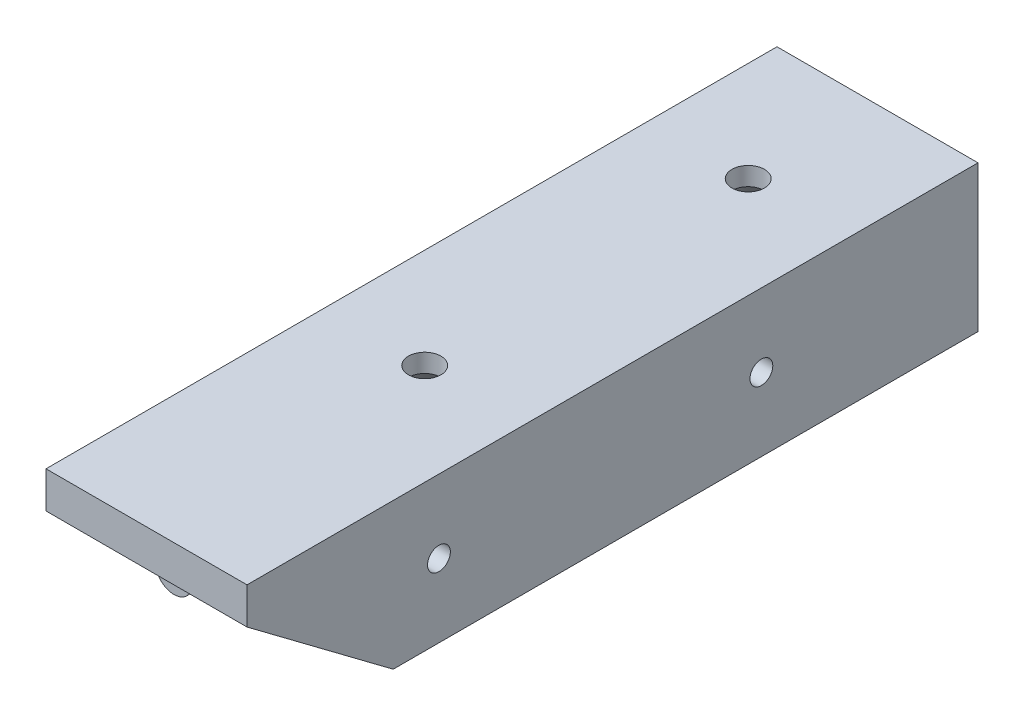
ISO-10303-21;
HEADER;
FILE_DESCRIPTION(('STEP AP214'),'2;1');
FILE_NAME('part.step','',(''),(''),'','','');
FILE_SCHEMA(('AUTOMOTIVE_DESIGN { 1 0 10303 214 1 1 1 1 }'));
ENDSEC;
DATA;
#1=APPLICATION_CONTEXT('core data for automotive mechanical design processes');
#2=APPLICATION_PROTOCOL_DEFINITION('international standard','automotive_design',2000,#1);
#3=PRODUCT_CONTEXT('',#1,'mechanical');
#4=PRODUCT('Part','Part','',(#3));
#5=PRODUCT_RELATED_PRODUCT_CATEGORY('part','',(#4));
#6=PRODUCT_DEFINITION_FORMATION('','',#4);
#7=PRODUCT_DEFINITION_CONTEXT('part definition',#1,'design');
#8=PRODUCT_DEFINITION('design','',#6,#7);
#9=PRODUCT_DEFINITION_SHAPE('','',#8);
#10=(LENGTH_UNIT() NAMED_UNIT(*) SI_UNIT(.MILLI.,.METRE.));
#11=(NAMED_UNIT(*) PLANE_ANGLE_UNIT() SI_UNIT($,.RADIAN.));
#12=(NAMED_UNIT(*) SI_UNIT($,.STERADIAN.) SOLID_ANGLE_UNIT());
#13=UNCERTAINTY_MEASURE_WITH_UNIT(LENGTH_MEASURE(1.E-05),#10,'distance_accuracy_value','');
#14=(GEOMETRIC_REPRESENTATION_CONTEXT(3) GLOBAL_UNCERTAINTY_ASSIGNED_CONTEXT((#13)) GLOBAL_UNIT_ASSIGNED_CONTEXT((#10,
#11,#12)) REPRESENTATION_CONTEXT('',''));
#15=CARTESIAN_POINT('',(0.,0.,0.));
#16=DIRECTION('',(0.,0.,1.));
#17=DIRECTION('',(1.,0.,0.));
#18=AXIS2_PLACEMENT_3D('',#15,#16,#17);
#19=CARTESIAN_POINT('',(-29.0033930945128,3.21723071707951,20.));
#20=DIRECTION('',(1.,0.,0.));
#21=DIRECTION('',(0.,0.,-1.));
#22=AXIS2_PLACEMENT_3D('',#19,#20,#21);
#23=PLANE('',#22);
#24=DIRECTION('',(0.,0.,1.));
#25=VECTOR('',#24,1.);
#26=CARTESIAN_POINT('',(-29.0033930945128,4.21723071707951,0.));
#27=LINE('',#26,#25);
#28=CARTESIAN_POINT('',(-29.0033930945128,4.21723071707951,20.));
#29=VERTEX_POINT('',#28);
#30=CARTESIAN_POINT('',(-29.0033930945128,4.21723071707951,21.));
#31=VERTEX_POINT('',#30);
#32=EDGE_CURVE('E192',#29,#31,#27,.T.);
#33=ORIENTED_EDGE('',*,*,#32,.T.);
#34=DIRECTION('',(0.,1.,0.));
#35=VECTOR('',#34,1.);
#36=CARTESIAN_POINT('',(-29.0033930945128,3.21723071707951,21.));
#37=LINE('',#36,#35);
#38=CARTESIAN_POINT('',(-29.0033930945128,5.21723071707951,21.));
#39=VERTEX_POINT('',#38);
#40=EDGE_CURVE('E238',#31,#39,#37,.T.);
#41=ORIENTED_EDGE('',*,*,#40,.T.);
#42=DIRECTION('',(0.,0.,-1.));
#43=VECTOR('',#42,1.);
#44=CARTESIAN_POINT('',(-29.0033930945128,5.21723071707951,20.));
#45=LINE('',#44,#43);
#46=CARTESIAN_POINT('',(-29.0033930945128,5.21723071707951,20.));
#47=VERTEX_POINT('',#46);
#48=EDGE_CURVE('E226',#39,#47,#45,.T.);
#49=ORIENTED_EDGE('',*,*,#48,.T.);
#50=DIRECTION('',(0.,1.,0.));
#51=VECTOR('',#50,1.);
#52=CARTESIAN_POINT('',(-29.0033930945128,3.21723071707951,20.));
#53=LINE('',#52,#51);
#54=EDGE_CURVE('E244',#29,#47,#53,.T.);
#55=ORIENTED_EDGE('',*,*,#54,.F.);
#56=EDGE_LOOP('',(#33,#41,#49,#55));
#57=FACE_BOUND('',#56,.T.);
#58=ADVANCED_FACE('F32',(#57),#23,.F.);
#59=CARTESIAN_POINT('',(-27.0033930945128,3.21723071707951,20.));
#60=DIRECTION('',(0.,0.,1.));
#61=DIRECTION('',(1.,0.,0.));
#62=AXIS2_PLACEMENT_3D('',#59,#60,#61);
#63=PLANE('',#62);
#64=CARTESIAN_POINT('',(-28.0033930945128,4.25896067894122,20.));
#65=DIRECTION('',(0.,0.,1.));
#66=DIRECTION('',(1.,0.,0.));
#67=AXIS2_PLACEMENT_3D('',#64,#65,#66);
#68=CIRCLE('',#67,1.0008703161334);
#69=CARTESIAN_POINT('',(-27.0033930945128,4.21723071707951,20.));
#70=VERTEX_POINT('',#69);
#71=EDGE_CURVE('E496',#29,#70,#68,.T.);
#72=ORIENTED_EDGE('',*,*,#71,.F.);
#73=ORIENTED_EDGE('',*,*,#54,.T.);
#74=DIRECTION('',(1.,0.,0.));
#75=VECTOR('',#74,1.);
#76=CARTESIAN_POINT('',(-27.0033930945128,5.21723071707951,20.));
#77=LINE('',#76,#75);
#78=CARTESIAN_POINT('',(-27.0033930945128,5.21723071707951,20.));
#79=VERTEX_POINT('',#78);
#80=EDGE_CURVE('E229',#47,#79,#77,.T.);
#81=ORIENTED_EDGE('',*,*,#80,.T.);
#82=DIRECTION('',(0.,1.,0.));
#83=VECTOR('',#82,1.);
#84=CARTESIAN_POINT('',(-27.0033930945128,3.21723071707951,20.));
#85=LINE('',#84,#83);
#86=EDGE_CURVE('E242',#70,#79,#85,.T.);
#87=ORIENTED_EDGE('',*,*,#86,.F.);
#88=EDGE_LOOP('',(#72,#73,#81,#87));
#89=FACE_BOUND('',#88,.T.);
#90=ADVANCED_FACE('F359',(#89),#63,.F.);
#91=CARTESIAN_POINT('',(-27.0033930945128,3.21723071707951,20.));
#92=DIRECTION('',(-1.,0.,0.));
#93=DIRECTION('',(0.,0.,1.));
#94=AXIS2_PLACEMENT_3D('',#91,#92,#93);
#95=PLANE('',#94);
#96=DIRECTION('',(0.,0.,1.));
#97=VECTOR('',#96,1.);
#98=CARTESIAN_POINT('',(-27.0033930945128,4.21723071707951,0.));
#99=LINE('',#98,#97);
#100=CARTESIAN_POINT('',(-27.0033930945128,4.21723071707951,21.));
#101=VERTEX_POINT('',#100);
#102=EDGE_CURVE('E47',#70,#101,#99,.T.);
#103=ORIENTED_EDGE('',*,*,#102,.F.);
#104=ORIENTED_EDGE('',*,*,#86,.T.);
#105=DIRECTION('',(0.,0.,1.));
#106=VECTOR('',#105,1.);
#107=CARTESIAN_POINT('',(-27.0033930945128,5.21723071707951,20.));
#108=LINE('',#107,#106);
#109=CARTESIAN_POINT('',(-27.0033930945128,5.21723071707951,21.));
#110=VERTEX_POINT('',#109);
#111=EDGE_CURVE('E232',#79,#110,#108,.T.);
#112=ORIENTED_EDGE('',*,*,#111,.T.);
#113=DIRECTION('',(0.,1.,0.));
#114=VECTOR('',#113,1.);
#115=CARTESIAN_POINT('',(-27.0033930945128,3.21723071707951,21.));
#116=LINE('',#115,#114);
#117=EDGE_CURVE('E240',#101,#110,#116,.T.);
#118=ORIENTED_EDGE('',*,*,#117,.F.);
#119=EDGE_LOOP('',(#103,#104,#112,#118));
#120=FACE_BOUND('',#119,.T.);
#121=ADVANCED_FACE('F365',(#120),#95,.F.);
#122=CARTESIAN_POINT('',(-27.0033930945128,3.21723071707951,21.));
#123=DIRECTION('',(0.,0.,-1.));
#124=DIRECTION('',(-1.,0.,0.));
#125=AXIS2_PLACEMENT_3D('',#122,#123,#124);
#126=PLANE('',#125);
#127=CARTESIAN_POINT('',(-28.0033930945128,4.25896067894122,21.));
#128=DIRECTION('',(0.,0.,-1.));
#129=DIRECTION('',(-1.,0.,0.));
#130=AXIS2_PLACEMENT_3D('',#127,#128,#129);
#131=CIRCLE('',#130,1.0008703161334);
#132=EDGE_CURVE('E498',#101,#31,#131,.T.);
#133=ORIENTED_EDGE('',*,*,#132,.F.);
#134=ORIENTED_EDGE('',*,*,#117,.T.);
#135=DIRECTION('',(-1.,0.,0.));
#136=VECTOR('',#135,1.);
#137=CARTESIAN_POINT('',(-27.0033930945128,5.21723071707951,21.));
#138=LINE('',#137,#136);
#139=EDGE_CURVE('E235',#110,#39,#138,.T.);
#140=ORIENTED_EDGE('',*,*,#139,.T.);
#141=ORIENTED_EDGE('',*,*,#40,.F.);
#142=EDGE_LOOP('',(#133,#134,#140,#141));
#143=FACE_BOUND('',#142,.T.);
#144=ADVANCED_FACE('F511',(#143),#126,.F.);
#145=CARTESIAN_POINT('',(-29.0033930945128,3.21723071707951,37.5));
#146=DIRECTION('',(1.,0.,0.));
#147=DIRECTION('',(0.,0.,-1.));
#148=AXIS2_PLACEMENT_3D('',#145,#146,#147);
#149=PLANE('',#148);
#150=CARTESIAN_POINT('',(-29.0033930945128,4.21723071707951,37.5));
#151=VERTEX_POINT('',#150);
#152=CARTESIAN_POINT('',(-29.0033930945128,4.21723071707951,38.5));
#153=VERTEX_POINT('',#152);
#154=EDGE_CURVE('E194',#151,#153,#27,.T.);
#155=ORIENTED_EDGE('',*,*,#154,.T.);
#156=DIRECTION('',(0.,1.,0.));
#157=VECTOR('',#156,1.);
#158=CARTESIAN_POINT('',(-29.0033930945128,3.21723071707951,38.5));
#159=LINE('',#158,#157);
#160=CARTESIAN_POINT('',(-29.0033930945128,5.21723071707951,38.5));
#161=VERTEX_POINT('',#160);
#162=EDGE_CURVE('E218',#153,#161,#159,.T.);
#163=ORIENTED_EDGE('',*,*,#162,.T.);
#164=DIRECTION('',(0.,0.,-1.));
#165=VECTOR('',#164,1.);
#166=CARTESIAN_POINT('',(-29.0033930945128,5.21723071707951,37.5));
#167=LINE('',#166,#165);
#168=CARTESIAN_POINT('',(-29.0033930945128,5.21723071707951,37.5));
#169=VERTEX_POINT('',#168);
#170=EDGE_CURVE('E201',#161,#169,#167,.T.);
#171=ORIENTED_EDGE('',*,*,#170,.T.);
#172=DIRECTION('',(0.,1.,0.));
#173=VECTOR('',#172,1.);
#174=CARTESIAN_POINT('',(-29.0033930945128,3.21723071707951,37.5));
#175=LINE('',#174,#173);
#176=EDGE_CURVE('E224',#151,#169,#175,.T.);
#177=ORIENTED_EDGE('',*,*,#176,.F.);
#178=EDGE_LOOP('',(#155,#163,#171,#177));
#179=FACE_BOUND('',#178,.T.);
#180=ADVANCED_FACE('F603',(#179),#149,.F.);
#181=CARTESIAN_POINT('',(-27.0033930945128,3.21723071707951,37.5));
#182=DIRECTION('',(0.,0.,1.));
#183=DIRECTION('',(1.,0.,0.));
#184=AXIS2_PLACEMENT_3D('',#181,#182,#183);
#185=PLANE('',#184);
#186=CARTESIAN_POINT('',(-28.0033930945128,4.25896067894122,37.5));
#187=DIRECTION('',(0.,0.,1.));
#188=DIRECTION('',(1.,0.,0.));
#189=AXIS2_PLACEMENT_3D('',#186,#187,#188);
#190=CIRCLE('',#189,1.0008703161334);
#191=CARTESIAN_POINT('',(-27.0033930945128,4.21723071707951,37.5));
#192=VERTEX_POINT('',#191);
#193=EDGE_CURVE('E500',#151,#192,#190,.T.);
#194=ORIENTED_EDGE('',*,*,#193,.F.);
#195=ORIENTED_EDGE('',*,*,#176,.T.);
#196=DIRECTION('',(1.,0.,0.));
#197=VECTOR('',#196,1.);
#198=CARTESIAN_POINT('',(-27.0033930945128,5.21723071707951,37.5));
#199=LINE('',#198,#197);
#200=CARTESIAN_POINT('',(-27.0033930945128,5.21723071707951,37.5));
#201=VERTEX_POINT('',#200);
#202=EDGE_CURVE('E209',#169,#201,#199,.T.);
#203=ORIENTED_EDGE('',*,*,#202,.T.);
#204=DIRECTION('',(0.,1.,0.));
#205=VECTOR('',#204,1.);
#206=CARTESIAN_POINT('',(-27.0033930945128,3.21723071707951,37.5));
#207=LINE('',#206,#205);
#208=EDGE_CURVE('E222',#192,#201,#207,.T.);
#209=ORIENTED_EDGE('',*,*,#208,.F.);
#210=EDGE_LOOP('',(#194,#195,#203,#209));
#211=FACE_BOUND('',#210,.T.);
#212=ADVANCED_FACE('F599',(#211),#185,.F.);
#213=CARTESIAN_POINT('',(-27.0033930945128,3.21723071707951,37.5));
#214=DIRECTION('',(-1.,0.,0.));
#215=DIRECTION('',(0.,0.,1.));
#216=AXIS2_PLACEMENT_3D('',#213,#214,#215);
#217=PLANE('',#216);
#218=CARTESIAN_POINT('',(-27.0033930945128,4.21723071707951,38.5));
#219=VERTEX_POINT('',#218);
#220=EDGE_CURVE('E55',#192,#219,#99,.T.);
#221=ORIENTED_EDGE('',*,*,#220,.F.);
#222=ORIENTED_EDGE('',*,*,#208,.T.);
#223=DIRECTION('',(0.,0.,1.));
#224=VECTOR('',#223,1.);
#225=CARTESIAN_POINT('',(-27.0033930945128,5.21723071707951,37.5));
#226=LINE('',#225,#224);
#227=CARTESIAN_POINT('',(-27.0033930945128,5.21723071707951,38.5));
#228=VERTEX_POINT('',#227);
#229=EDGE_CURVE('E212',#201,#228,#226,.T.);
#230=ORIENTED_EDGE('',*,*,#229,.T.);
#231=DIRECTION('',(0.,1.,0.));
#232=VECTOR('',#231,1.);
#233=CARTESIAN_POINT('',(-27.0033930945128,3.21723071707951,38.5));
#234=LINE('',#233,#232);
#235=EDGE_CURVE('E220',#219,#228,#234,.T.);
#236=ORIENTED_EDGE('',*,*,#235,.F.);
#237=EDGE_LOOP('',(#221,#222,#230,#236));
#238=FACE_BOUND('',#237,.T.);
#239=ADVANCED_FACE('F595',(#238),#217,.F.);
#240=CARTESIAN_POINT('',(-27.0033930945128,3.21723071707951,38.5));
#241=DIRECTION('',(0.,0.,-1.));
#242=DIRECTION('',(-1.,0.,0.));
#243=AXIS2_PLACEMENT_3D('',#240,#241,#242);
#244=PLANE('',#243);
#245=CARTESIAN_POINT('',(-28.0033930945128,4.25896067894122,38.5));
#246=DIRECTION('',(0.,0.,-1.));
#247=DIRECTION('',(-1.,0.,0.));
#248=AXIS2_PLACEMENT_3D('',#245,#246,#247);
#249=CIRCLE('',#248,1.0008703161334);
#250=EDGE_CURVE('E183',#219,#153,#249,.T.);
#251=ORIENTED_EDGE('',*,*,#250,.F.);
#252=ORIENTED_EDGE('',*,*,#235,.T.);
#253=DIRECTION('',(-1.,0.,0.));
#254=VECTOR('',#253,1.);
#255=CARTESIAN_POINT('',(-27.0033930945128,5.21723071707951,38.5));
#256=LINE('',#255,#254);
#257=EDGE_CURVE('E215',#228,#161,#256,.T.);
#258=ORIENTED_EDGE('',*,*,#257,.T.);
#259=ORIENTED_EDGE('',*,*,#162,.F.);
#260=EDGE_LOOP('',(#251,#252,#258,#259));
#261=FACE_BOUND('',#260,.T.);
#262=ADVANCED_FACE('F592',(#261),#244,.F.);
#263=CARTESIAN_POINT('',(-27.0033930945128,3.21723071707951,3.30456731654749));
#264=DIRECTION('',(-1.,0.,0.));
#265=DIRECTION('',(0.,0.,1.));
#266=AXIS2_PLACEMENT_3D('',#263,#264,#265);
#267=PLANE('',#266);
#268=CARTESIAN_POINT('',(-27.0033930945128,4.21723071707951,2.30456731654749));
#269=VERTEX_POINT('',#268);
#270=CARTESIAN_POINT('',(-27.0033930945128,4.21723071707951,3.30456731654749));
#271=VERTEX_POINT('',#270);
#272=EDGE_CURVE('E179',#269,#271,#99,.T.);
#273=ORIENTED_EDGE('',*,*,#272,.F.);
#274=DIRECTION('',(0.,1.,0.));
#275=VECTOR('',#274,1.);
#276=CARTESIAN_POINT('',(-27.0033930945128,3.21723071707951,2.30456731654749));
#277=LINE('',#276,#275);
#278=CARTESIAN_POINT('',(-27.0033930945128,5.21723071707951,2.30456731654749));
#279=VERTEX_POINT('',#278);
#280=EDGE_CURVE('E203',#269,#279,#277,.T.);
#281=ORIENTED_EDGE('',*,*,#280,.T.);
#282=DIRECTION('',(0.,0.,1.));
#283=VECTOR('',#282,1.);
#284=CARTESIAN_POINT('',(-27.0033930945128,5.21723071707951,3.30456731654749));
#285=LINE('',#284,#283);
#286=CARTESIAN_POINT('',(-27.0033930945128,5.21723071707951,3.30456731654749));
#287=VERTEX_POINT('',#286);
#288=EDGE_CURVE('E444',#279,#287,#285,.T.);
#289=ORIENTED_EDGE('',*,*,#288,.T.);
#290=DIRECTION('',(0.,1.,0.));
#291=VECTOR('',#290,1.);
#292=CARTESIAN_POINT('',(-27.0033930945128,3.21723071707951,3.30456731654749));
#293=LINE('',#292,#291);
#294=EDGE_CURVE('E199',#271,#287,#293,.T.);
#295=ORIENTED_EDGE('',*,*,#294,.F.);
#296=EDGE_LOOP('',(#273,#281,#289,#295));
#297=FACE_BOUND('',#296,.T.);
#298=ADVANCED_FACE('F589',(#297),#267,.F.);
#299=CARTESIAN_POINT('',(-29.0033930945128,3.21723071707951,3.30456731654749));
#300=DIRECTION('',(0.,0.,-1.));
#301=DIRECTION('',(-1.,0.,0.));
#302=AXIS2_PLACEMENT_3D('',#299,#300,#301);
#303=PLANE('',#302);
#304=CARTESIAN_POINT('',(-28.0033930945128,4.25896067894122,3.30456731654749));
#305=DIRECTION('',(0.,0.,-1.));
#306=DIRECTION('',(-1.,0.,0.));
#307=AXIS2_PLACEMENT_3D('',#304,#305,#306);
#308=CIRCLE('',#307,1.0008703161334);
#309=CARTESIAN_POINT('',(-29.0033930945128,4.21723071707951,3.30456731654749));
#310=VERTEX_POINT('',#309);
#311=EDGE_CURVE('E173',#271,#310,#308,.T.);
#312=ORIENTED_EDGE('',*,*,#311,.F.);
#313=ORIENTED_EDGE('',*,*,#294,.T.);
#314=DIRECTION('',(-1.,0.,0.));
#315=VECTOR('',#314,1.);
#316=CARTESIAN_POINT('',(-29.0033930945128,5.21723071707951,3.30456731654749));
#317=LINE('',#316,#315);
#318=CARTESIAN_POINT('',(-29.0033930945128,5.21723071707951,3.30456731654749));
#319=VERTEX_POINT('',#318);
#320=EDGE_CURVE('E198',#287,#319,#317,.T.);
#321=ORIENTED_EDGE('',*,*,#320,.T.);
#322=DIRECTION('',(0.,1.,0.));
#323=VECTOR('',#322,1.);
#324=CARTESIAN_POINT('',(-29.0033930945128,3.21723071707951,3.30456731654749));
#325=LINE('',#324,#323);
#326=EDGE_CURVE('E189',#310,#319,#325,.T.);
#327=ORIENTED_EDGE('',*,*,#326,.F.);
#328=EDGE_LOOP('',(#312,#313,#321,#327));
#329=FACE_BOUND('',#328,.T.);
#330=ADVANCED_FACE('F196',(#329),#303,.F.);
#331=CARTESIAN_POINT('',(-29.0033930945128,3.21723071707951,3.30456731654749));
#332=DIRECTION('',(1.,0.,0.));
#333=DIRECTION('',(0.,0.,-1.));
#334=AXIS2_PLACEMENT_3D('',#331,#332,#333);
#335=PLANE('',#334);
#336=CARTESIAN_POINT('',(-29.0033930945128,4.21723071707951,2.30456731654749));
#337=VERTEX_POINT('',#336);
#338=EDGE_CURVE('E176',#337,#310,#27,.T.);
#339=ORIENTED_EDGE('',*,*,#338,.T.);
#340=ORIENTED_EDGE('',*,*,#326,.T.);
#341=DIRECTION('',(0.,0.,-1.));
#342=VECTOR('',#341,1.);
#343=CARTESIAN_POINT('',(-29.0033930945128,5.21723071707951,3.30456731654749));
#344=LINE('',#343,#342);
#345=CARTESIAN_POINT('',(-29.0033930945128,5.21723071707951,2.30456731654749));
#346=VERTEX_POINT('',#345);
#347=EDGE_CURVE('E451',#319,#346,#344,.T.);
#348=ORIENTED_EDGE('',*,*,#347,.T.);
#349=DIRECTION('',(0.,1.,0.));
#350=VECTOR('',#349,1.);
#351=CARTESIAN_POINT('',(-29.0033930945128,3.21723071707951,2.30456731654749));
#352=LINE('',#351,#350);
#353=EDGE_CURVE('E191',#337,#346,#352,.T.);
#354=ORIENTED_EDGE('',*,*,#353,.F.);
#355=EDGE_LOOP('',(#339,#340,#348,#354));
#356=FACE_BOUND('',#355,.T.);
#357=ADVANCED_FACE('F187',(#356),#335,.F.);
#358=CARTESIAN_POINT('',(-29.0033930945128,3.21723071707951,2.30456731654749));
#359=DIRECTION('',(0.,0.,1.));
#360=DIRECTION('',(1.,0.,0.));
#361=AXIS2_PLACEMENT_3D('',#358,#359,#360);
#362=PLANE('',#361);
#363=CARTESIAN_POINT('',(-28.0033930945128,4.25896067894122,2.30456731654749));
#364=DIRECTION('',(0.,0.,1.));
#365=DIRECTION('',(1.,0.,0.));
#366=AXIS2_PLACEMENT_3D('',#363,#364,#365);
#367=CIRCLE('',#366,1.0008703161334);
#368=EDGE_CURVE('E11',#337,#269,#367,.T.);
#369=ORIENTED_EDGE('',*,*,#368,.F.);
#370=ORIENTED_EDGE('',*,*,#353,.T.);
#371=DIRECTION('',(1.,0.,0.));
#372=VECTOR('',#371,1.);
#373=CARTESIAN_POINT('',(-29.0033930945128,5.21723071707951,2.30456731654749));
#374=LINE('',#373,#372);
#375=EDGE_CURVE('E446',#346,#279,#374,.T.);
#376=ORIENTED_EDGE('',*,*,#375,.T.);
#377=ORIENTED_EDGE('',*,*,#280,.F.);
#378=EDGE_LOOP('',(#369,#370,#376,#377));
#379=FACE_BOUND('',#378,.T.);
#380=ADVANCED_FACE('F344',(#379),#362,.F.);
#381=CARTESIAN_POINT('',(-31.5033930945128,-0.782769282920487,40.));
#382=DIRECTION('',(-1.,0.,0.));
#383=DIRECTION('',(0.,0.,1.));
#384=AXIS2_PLACEMENT_3D('',#381,#382,#383);
#385=PLANE('',#384);
#386=CARTESIAN_POINT('',(-31.5033930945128,3.21723071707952,29.4696754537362));
#387=DIRECTION('',(-1.,0.,0.));
#388=DIRECTION('',(0.,0.,1.));
#389=AXIS2_PLACEMENT_3D('',#386,#387,#388);
#390=CIRCLE('',#389,1.5);
#391=CARTESIAN_POINT('',(-31.5033930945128,3.21723071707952,30.9696754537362));
#392=VERTEX_POINT('',#391);
#393=EDGE_CURVE('E334',#392,#392,#390,.F.);
#394=ORIENTED_EDGE('',*,*,#393,.F.);
#395=EDGE_LOOP('',(#394));
#396=FACE_BOUND('',#395,.T.);
#397=DIRECTION('',(0.,0.,-1.));
#398=VECTOR('',#397,1.);
#399=CARTESIAN_POINT('',(-31.5033930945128,5.21723071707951,40.));
#400=LINE('',#399,#398);
#401=CARTESIAN_POINT('',(-31.5033930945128,5.21723071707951,40.));
#402=VERTEX_POINT('',#401);
#403=CARTESIAN_POINT('',(-31.5033930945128,5.21723071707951,0.));
#404=VERTEX_POINT('',#403);
#405=EDGE_CURVE('E320',#402,#404,#400,.T.);
#406=ORIENTED_EDGE('',*,*,#405,.F.);
#407=DIRECTION('',(0.,-0.6,-0.8));
#408=VECTOR('',#407,1.);
#409=CARTESIAN_POINT('',(-31.5033930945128,3.05723071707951,37.12));
#410=LINE('',#409,#408);
#411=CARTESIAN_POINT('',(-31.5033930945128,-0.782769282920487,32.));
#412=VERTEX_POINT('',#411);
#413=EDGE_CURVE('E272',#402,#412,#410,.T.);
#414=ORIENTED_EDGE('',*,*,#413,.T.);
#415=DIRECTION('',(0.,0.,-1.));
#416=VECTOR('',#415,1.);
#417=CARTESIAN_POINT('',(-31.5033930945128,-0.782769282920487,40.));
#418=LINE('',#417,#416);
#419=CARTESIAN_POINT('',(-31.5033930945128,-0.782769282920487,0.));
#420=VERTEX_POINT('',#419);
#421=EDGE_CURVE('E323',#412,#420,#418,.T.);
#422=ORIENTED_EDGE('',*,*,#421,.T.);
#423=DIRECTION('',(0.,1.,0.));
#424=VECTOR('',#423,1.);
#425=CARTESIAN_POINT('',(-31.5033930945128,-0.782769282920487,0.));
#426=LINE('',#425,#424);
#427=EDGE_CURVE('E290',#420,#404,#426,.T.);
#428=ORIENTED_EDGE('',*,*,#427,.T.);
#429=EDGE_LOOP('',(#406,#414,#422,#428));
#430=FACE_BOUND('',#429,.T.);
#431=CARTESIAN_POINT('',(-31.5033930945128,3.21723071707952,11.8725132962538));
#432=DIRECTION('',(-1.,0.,0.));
#433=DIRECTION('',(0.,0.,1.));
#434=AXIS2_PLACEMENT_3D('',#431,#432,#433);
#435=CIRCLE('',#434,1.5);
#436=CARTESIAN_POINT('',(-31.5033930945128,3.21723071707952,13.3725132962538));
#437=VERTEX_POINT('',#436);
#438=EDGE_CURVE('E40',#437,#437,#435,.F.);
#439=ORIENTED_EDGE('',*,*,#438,.F.);
#440=EDGE_LOOP('',(#439));
#441=FACE_BOUND('',#440,.T.);
#442=ADVANCED_FACE('F341',(#396,#430,#441),#385,.F.);
#443=CARTESIAN_POINT('',(-24.5033930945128,5.21723071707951,40.));
#444=DIRECTION('',(1.,0.,0.));
#445=DIRECTION('',(0.,0.,-1.));
#446=AXIS2_PLACEMENT_3D('',#443,#444,#445);
#447=PLANE('',#446);
#448=DIRECTION('',(0.,0.,-1.));
#449=VECTOR('',#448,1.);
#450=CARTESIAN_POINT('',(-24.5033930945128,-0.782769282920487,40.));
#451=LINE('',#450,#449);
#452=CARTESIAN_POINT('',(-24.5033930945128,-0.782769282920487,32.));
#453=VERTEX_POINT('',#452);
#454=CARTESIAN_POINT('',(-24.5033930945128,-0.782769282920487,0.));
#455=VERTEX_POINT('',#454);
#456=EDGE_CURVE('E315',#453,#455,#451,.T.);
#457=ORIENTED_EDGE('',*,*,#456,.F.);
#458=DIRECTION('',(0.,0.6,0.8));
#459=VECTOR('',#458,1.);
#460=CARTESIAN_POINT('',(-24.5033930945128,5.21723071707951,40.));
#461=LINE('',#460,#459);
#462=CARTESIAN_POINT('',(-24.5033930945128,5.21723071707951,40.));
#463=VERTEX_POINT('',#462);
#464=EDGE_CURVE('E269',#453,#463,#461,.T.);
#465=ORIENTED_EDGE('',*,*,#464,.T.);
#466=DIRECTION('',(0.,0.,-1.));
#467=VECTOR('',#466,1.);
#468=CARTESIAN_POINT('',(-24.5033930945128,5.21723071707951,40.));
#469=LINE('',#468,#467);
#470=CARTESIAN_POINT('',(-24.5033930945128,5.21723071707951,0.));
#471=VERTEX_POINT('',#470);
#472=EDGE_CURVE('E317',#463,#471,#469,.T.);
#473=ORIENTED_EDGE('',*,*,#472,.T.);
#474=DIRECTION('',(0.,-1.,0.));
#475=VECTOR('',#474,1.);
#476=CARTESIAN_POINT('',(-24.5033930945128,5.21723071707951,0.));
#477=LINE('',#476,#475);
#478=EDGE_CURVE('E294',#471,#455,#477,.T.);
#479=ORIENTED_EDGE('',*,*,#478,.T.);
#480=EDGE_LOOP('',(#457,#465,#473,#479));
#481=FACE_BOUND('',#480,.T.);
#482=CARTESIAN_POINT('',(-24.5033930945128,3.21723071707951,29.4974005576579));
#483=DIRECTION('',(1.,0.,0.));
#484=DIRECTION('',(0.,0.,-1.));
#485=AXIS2_PLACEMENT_3D('',#482,#483,#484);
#486=CIRCLE('',#485,1.5);
#487=CARTESIAN_POINT('',(-24.5033930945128,3.21723071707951,27.9974005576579));
#488=VERTEX_POINT('',#487);
#489=EDGE_CURVE('E328',#488,#488,#486,.F.);
#490=ORIENTED_EDGE('',*,*,#489,.F.);
#491=EDGE_LOOP('',(#490));
#492=FACE_BOUND('',#491,.T.);
#493=CARTESIAN_POINT('',(-24.5033930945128,3.21723071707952,11.8538617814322));
#494=DIRECTION('',(1.,0.,0.));
#495=DIRECTION('',(0.,0.,-1.));
#496=AXIS2_PLACEMENT_3D('',#493,#494,#495);
#497=CIRCLE('',#496,1.5);
#498=CARTESIAN_POINT('',(-24.5033930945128,3.21723071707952,10.3538617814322));
#499=VERTEX_POINT('',#498);
#500=EDGE_CURVE('E331',#499,#499,#497,.F.);
#501=ORIENTED_EDGE('',*,*,#500,.F.);
#502=EDGE_LOOP('',(#501));
#503=FACE_BOUND('',#502,.T.);
#504=ADVANCED_FACE('F343',(#481,#492,#503),#447,.F.);
#505=CARTESIAN_POINT('',(-31.5033930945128,5.21723071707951,40.));
#506=DIRECTION('',(0.,1.,0.));
#507=DIRECTION('',(0.,0.,1.));
#508=AXIS2_PLACEMENT_3D('',#505,#506,#507);
#509=PLANE('',#508);
#510=CARTESIAN_POINT('',(-28.0380823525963,5.21723071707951,24.742291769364));
#511=DIRECTION('',(0.,-1.,0.));
#512=DIRECTION('',(0.,0.,-1.));
#513=AXIS2_PLACEMENT_3D('',#510,#511,#512);
#514=CIRCLE('',#513,1.7526);
#515=CARTESIAN_POINT('',(-28.0380823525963,5.21723071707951,22.989691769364));
#516=VERTEX_POINT('',#515);
#517=EDGE_CURVE('E425',#516,#516,#514,.T.);
#518=ORIENTED_EDGE('',*,*,#517,.F.);
#519=EDGE_LOOP('',(#518));
#520=FACE_BOUND('',#519,.T.);
#521=CARTESIAN_POINT('',(-28.0380823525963,5.21723071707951,7.04050870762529));
#522=DIRECTION('',(0.,-1.,0.));
#523=DIRECTION('',(0.,0.,-1.));
#524=AXIS2_PLACEMENT_3D('',#521,#522,#523);
#525=CIRCLE('',#524,1.7526);
#526=CARTESIAN_POINT('',(-28.0380823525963,5.21723071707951,5.28790870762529));
#527=VERTEX_POINT('',#526);
#528=EDGE_CURVE('E429',#527,#527,#525,.T.);
#529=ORIENTED_EDGE('',*,*,#528,.F.);
#530=EDGE_LOOP('',(#529));
#531=FACE_BOUND('',#530,.T.);
#532=ORIENTED_EDGE('',*,*,#170,.F.);
#533=ORIENTED_EDGE('',*,*,#257,.F.);
#534=ORIENTED_EDGE('',*,*,#229,.F.);
#535=ORIENTED_EDGE('',*,*,#202,.F.);
#536=EDGE_LOOP('',(#532,#533,#534,#535));
#537=FACE_BOUND('',#536,.T.);
#538=DIRECTION('',(1.,0.,0.));
#539=VECTOR('',#538,1.);
#540=CARTESIAN_POINT('',(-31.5033930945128,5.21723071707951,0.));
#541=LINE('',#540,#539);
#542=EDGE_CURVE('E292',#404,#471,#541,.T.);
#543=ORIENTED_EDGE('',*,*,#542,.T.);
#544=ORIENTED_EDGE('',*,*,#472,.F.);
#545=DIRECTION('',(1.,0.,0.));
#546=VECTOR('',#545,1.);
#547=CARTESIAN_POINT('',(-31.5033930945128,5.21723071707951,40.));
#548=LINE('',#547,#546);
#549=EDGE_CURVE('E276',#402,#463,#548,.T.);
#550=ORIENTED_EDGE('',*,*,#549,.F.);
#551=ORIENTED_EDGE('',*,*,#405,.T.);
#552=EDGE_LOOP('',(#543,#544,#550,#551));
#553=FACE_BOUND('',#552,.T.);
#554=ORIENTED_EDGE('',*,*,#48,.F.);
#555=ORIENTED_EDGE('',*,*,#139,.F.);
#556=ORIENTED_EDGE('',*,*,#111,.F.);
#557=ORIENTED_EDGE('',*,*,#80,.F.);
#558=EDGE_LOOP('',(#554,#555,#556,#557));
#559=FACE_BOUND('',#558,.T.);
#560=ORIENTED_EDGE('',*,*,#288,.F.);
#561=ORIENTED_EDGE('',*,*,#375,.F.);
#562=ORIENTED_EDGE('',*,*,#347,.F.);
#563=ORIENTED_EDGE('',*,*,#320,.F.);
#564=EDGE_LOOP('',(#560,#561,#562,#563));
#565=FACE_BOUND('',#564,.T.);
#566=ADVANCED_FACE('F350',(#520,#531,#537,#553,#559,#565),#509,.F.);
#567=CARTESIAN_POINT('',(-33.5033930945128,-0.782769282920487,40.));
#568=DIRECTION('',(0.,1.,0.));
#569=DIRECTION('',(0.,0.,1.));
#570=AXIS2_PLACEMENT_3D('',#567,#568,#569);
#571=PLANE('',#570);
#572=ORIENTED_EDGE('',*,*,#421,.F.);
#573=DIRECTION('',(1.,0.,0.));
#574=VECTOR('',#573,1.);
#575=CARTESIAN_POINT('',(-37.5033930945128,-0.782769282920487,32.));
#576=LINE('',#575,#574);
#577=CARTESIAN_POINT('',(-33.5033930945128,-0.782769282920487,32.));
#578=VERTEX_POINT('',#577);
#579=EDGE_CURVE('E265',#578,#412,#576,.T.);
#580=ORIENTED_EDGE('',*,*,#579,.F.);
#581=DIRECTION('',(0.,0.,-1.));
#582=VECTOR('',#581,1.);
#583=CARTESIAN_POINT('',(-33.5033930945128,-0.782769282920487,40.));
#584=LINE('',#583,#582);
#585=CARTESIAN_POINT('',(-33.5033930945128,-0.782769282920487,0.));
#586=VERTEX_POINT('',#585);
#587=EDGE_CURVE('E287',#578,#586,#584,.T.);
#588=ORIENTED_EDGE('',*,*,#587,.T.);
#589=DIRECTION('',(1.,0.,0.));
#590=VECTOR('',#589,1.);
#591=CARTESIAN_POINT('',(-33.5033930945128,-0.782769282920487,0.));
#592=LINE('',#591,#590);
#593=EDGE_CURVE('E275',#586,#420,#592,.T.);
#594=ORIENTED_EDGE('',*,*,#593,.T.);
#595=EDGE_LOOP('',(#572,#580,#588,#594));
#596=FACE_BOUND('',#595,.T.);
#597=ADVANCED_FACE('F34',(#596),#571,.F.);
#598=CARTESIAN_POINT('',(-24.5033930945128,-0.782769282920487,40.));
#599=DIRECTION('',(0.,1.,0.));
#600=DIRECTION('',(-1.,0.,0.));
#601=AXIS2_PLACEMENT_3D('',#598,#599,#600);
#602=PLANE('',#601);
#603=DIRECTION('',(0.,0.,-1.));
#604=VECTOR('',#603,1.);
#605=CARTESIAN_POINT('',(-22.5033930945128,-0.782769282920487,40.));
#606=LINE('',#605,#604);
#607=CARTESIAN_POINT('',(-22.5033930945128,-0.782769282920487,32.));
#608=VERTEX_POINT('',#607);
#609=CARTESIAN_POINT('',(-22.5033930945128,-0.782769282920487,0.));
#610=VERTEX_POINT('',#609);
#611=EDGE_CURVE('E313',#608,#610,#606,.T.);
#612=ORIENTED_EDGE('',*,*,#611,.F.);
#613=EDGE_CURVE('E263',#453,#608,#576,.T.);
#614=ORIENTED_EDGE('',*,*,#613,.F.);
#615=ORIENTED_EDGE('',*,*,#456,.T.);
#616=DIRECTION('',(1.,0.,0.));
#617=VECTOR('',#616,1.);
#618=CARTESIAN_POINT('',(-24.5033930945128,-0.782769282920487,0.));
#619=LINE('',#618,#617);
#620=EDGE_CURVE('E297',#455,#610,#619,.T.);
#621=ORIENTED_EDGE('',*,*,#620,.T.);
#622=EDGE_LOOP('',(#612,#614,#615,#621));
#623=FACE_BOUND('',#622,.T.);
#624=ADVANCED_FACE('F412',(#623),#602,.F.);
#625=CARTESIAN_POINT('',(-22.5033930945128,7.21723071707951,40.));
#626=DIRECTION('',(-1.,0.,0.));
#627=DIRECTION('',(0.,0.,1.));
#628=AXIS2_PLACEMENT_3D('',#625,#626,#627);
#629=PLANE('',#628);
#630=CARTESIAN_POINT('',(-22.5033930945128,3.21723071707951,29.4974005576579));
#631=DIRECTION('',(1.,0.,0.));
#632=DIRECTION('',(0.,0.,-1.));
#633=AXIS2_PLACEMENT_3D('',#630,#631,#632);
#634=CIRCLE('',#633,0.624999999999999);
#635=CARTESIAN_POINT('',(-22.5033930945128,3.21723071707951,28.8724005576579));
#636=VERTEX_POINT('',#635);
#637=EDGE_CURVE('E252',#636,#636,#634,.T.);
#638=ORIENTED_EDGE('',*,*,#637,.F.);
#639=EDGE_LOOP('',(#638));
#640=FACE_BOUND('',#639,.T.);
#641=CARTESIAN_POINT('',(-22.5033930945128,3.21723071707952,11.8538617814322));
#642=DIRECTION('',(1.,0.,0.));
#643=DIRECTION('',(0.,0.,-1.));
#644=AXIS2_PLACEMENT_3D('',#641,#642,#643);
#645=CIRCLE('',#644,0.624999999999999);
#646=CARTESIAN_POINT('',(-22.5033930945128,3.21723071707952,11.2288617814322));
#647=VERTEX_POINT('',#646);
#648=EDGE_CURVE('E256',#647,#647,#645,.T.);
#649=ORIENTED_EDGE('',*,*,#648,.F.);
#650=EDGE_LOOP('',(#649));
#651=FACE_BOUND('',#650,.T.);
#652=DIRECTION('',(0.,1.,0.));
#653=VECTOR('',#652,1.);
#654=CARTESIAN_POINT('',(-22.5033930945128,7.21723071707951,40.));
#655=LINE('',#654,#653);
#656=CARTESIAN_POINT('',(-22.5033930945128,5.21723071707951,40.));
#657=VERTEX_POINT('',#656);
#658=CARTESIAN_POINT('',(-22.5033930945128,7.21723071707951,40.));
#659=VERTEX_POINT('',#658);
#660=EDGE_CURVE('E279',#657,#659,#655,.T.);
#661=ORIENTED_EDGE('',*,*,#660,.F.);
#662=DIRECTION('',(0.,0.6,0.8));
#663=VECTOR('',#662,1.);
#664=CARTESIAN_POINT('',(-22.5033930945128,-15.8609723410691,11.8957292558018));
#665=LINE('',#664,#663);
#666=EDGE_CURVE('E261',#608,#657,#665,.T.);
#667=ORIENTED_EDGE('',*,*,#666,.F.);
#668=ORIENTED_EDGE('',*,*,#611,.T.);
#669=DIRECTION('',(0.,1.,0.));
#670=VECTOR('',#669,1.);
#671=CARTESIAN_POINT('',(-22.5033930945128,7.21723071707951,0.));
#672=LINE('',#671,#670);
#673=CARTESIAN_POINT('',(-22.5033930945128,7.21723071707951,0.));
#674=VERTEX_POINT('',#673);
#675=EDGE_CURVE('E300',#610,#674,#672,.T.);
#676=ORIENTED_EDGE('',*,*,#675,.T.);
#677=DIRECTION('',(0.,0.,-1.));
#678=VECTOR('',#677,1.);
#679=CARTESIAN_POINT('',(-22.5033930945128,7.21723071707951,40.));
#680=LINE('',#679,#678);
#681=EDGE_CURVE('E310',#659,#674,#680,.T.);
#682=ORIENTED_EDGE('',*,*,#681,.F.);
#683=EDGE_LOOP('',(#661,#667,#668,#676,#682));
#684=FACE_BOUND('',#683,.T.);
#685=ADVANCED_FACE('F408',(#640,#651,#684),#629,.F.);
#686=CARTESIAN_POINT('',(-33.5033930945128,7.21723071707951,40.));
#687=DIRECTION('',(0.,-1.,0.));
#688=DIRECTION('',(0.,0.,-1.));
#689=AXIS2_PLACEMENT_3D('',#686,#687,#688);
#690=PLANE('',#689);
#691=CARTESIAN_POINT('',(-28.0380823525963,7.21723071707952,24.742291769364));
#692=DIRECTION('',(0.,-1.,0.));
#693=DIRECTION('',(0.,0.,-1.));
#694=AXIS2_PLACEMENT_3D('',#691,#692,#693);
#695=CIRCLE('',#694,0.888999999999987);
#696=CARTESIAN_POINT('',(-28.0380823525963,7.21723071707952,23.8532917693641));
#697=VERTEX_POINT('',#696);
#698=EDGE_CURVE('E489',#697,#697,#695,.T.);
#699=ORIENTED_EDGE('',*,*,#698,.T.);
#700=EDGE_LOOP('',(#699));
#701=FACE_BOUND('',#700,.T.);
#702=CARTESIAN_POINT('',(-28.0380823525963,7.21723071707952,7.04050870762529));
#703=DIRECTION('',(0.,-1.,0.));
#704=DIRECTION('',(0.,0.,-1.));
#705=AXIS2_PLACEMENT_3D('',#702,#703,#704);
#706=CIRCLE('',#705,0.888999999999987);
#707=CARTESIAN_POINT('',(-28.0380823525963,7.21723071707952,6.15150870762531));
#708=VERTEX_POINT('',#707);
#709=EDGE_CURVE('E482',#708,#708,#706,.T.);
#710=ORIENTED_EDGE('',*,*,#709,.T.);
#711=EDGE_LOOP('',(#710));
#712=FACE_BOUND('',#711,.T.);
#713=DIRECTION('',(-1.,0.,0.));
#714=VECTOR('',#713,1.);
#715=CARTESIAN_POINT('',(-33.5033930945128,7.21723071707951,0.));
#716=LINE('',#715,#714);
#717=CARTESIAN_POINT('',(-33.5033930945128,7.21723071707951,0.));
#718=VERTEX_POINT('',#717);
#719=EDGE_CURVE('E302',#674,#718,#716,.T.);
#720=ORIENTED_EDGE('',*,*,#719,.T.);
#721=DIRECTION('',(0.,0.,-1.));
#722=VECTOR('',#721,1.);
#723=CARTESIAN_POINT('',(-33.5033930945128,7.21723071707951,40.));
#724=LINE('',#723,#722);
#725=CARTESIAN_POINT('',(-33.5033930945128,7.21723071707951,40.));
#726=VERTEX_POINT('',#725);
#727=EDGE_CURVE('E307',#726,#718,#724,.T.);
#728=ORIENTED_EDGE('',*,*,#727,.F.);
#729=DIRECTION('',(-1.,0.,0.));
#730=VECTOR('',#729,1.);
#731=CARTESIAN_POINT('',(-33.5033930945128,7.21723071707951,40.));
#732=LINE('',#731,#730);
#733=EDGE_CURVE('E282',#659,#726,#732,.T.);
#734=ORIENTED_EDGE('',*,*,#733,.F.);
#735=ORIENTED_EDGE('',*,*,#681,.T.);
#736=EDGE_LOOP('',(#720,#728,#734,#735));
#737=FACE_BOUND('',#736,.T.);
#738=ADVANCED_FACE('F404',(#701,#712,#737),#690,.F.);
#739=CARTESIAN_POINT('',(-33.5033930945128,-0.782769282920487,40.));
#740=DIRECTION('',(1.,0.,0.));
#741=DIRECTION('',(0.,0.,-1.));
#742=AXIS2_PLACEMENT_3D('',#739,#740,#741);
#743=PLANE('',#742);
#744=CARTESIAN_POINT('',(-33.5033930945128,3.21723071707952,29.4696754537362));
#745=DIRECTION('',(-1.,0.,0.));
#746=DIRECTION('',(0.,0.,1.));
#747=AXIS2_PLACEMENT_3D('',#744,#745,#746);
#748=CIRCLE('',#747,0.624999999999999);
#749=CARTESIAN_POINT('',(-33.5033930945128,3.21723071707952,30.0946754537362));
#750=VERTEX_POINT('',#749);
#751=EDGE_CURVE('E246',#750,#750,#748,.T.);
#752=ORIENTED_EDGE('',*,*,#751,.F.);
#753=EDGE_LOOP('',(#752));
#754=FACE_BOUND('',#753,.T.);
#755=CARTESIAN_POINT('',(-33.5033930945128,3.21723071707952,11.8725132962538));
#756=DIRECTION('',(-1.,0.,0.));
#757=DIRECTION('',(0.,0.,1.));
#758=AXIS2_PLACEMENT_3D('',#755,#756,#757);
#759=CIRCLE('',#758,0.625000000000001);
#760=CARTESIAN_POINT('',(-33.5033930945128,3.21723071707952,12.4975132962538));
#761=VERTEX_POINT('',#760);
#762=EDGE_CURVE('E249',#761,#761,#759,.T.);
#763=ORIENTED_EDGE('',*,*,#762,.F.);
#764=EDGE_LOOP('',(#763));
#765=FACE_BOUND('',#764,.T.);
#766=ORIENTED_EDGE('',*,*,#587,.F.);
#767=DIRECTION('',(0.,0.6,0.8));
#768=VECTOR('',#767,1.);
#769=CARTESIAN_POINT('',(-33.5033930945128,3.05723071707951,37.12));
#770=LINE('',#769,#768);
#771=CARTESIAN_POINT('',(-33.5033930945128,5.21723071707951,40.));
#772=VERTEX_POINT('',#771);
#773=EDGE_CURVE('E266',#578,#772,#770,.T.);
#774=ORIENTED_EDGE('',*,*,#773,.T.);
#775=DIRECTION('',(0.,-1.,0.));
#776=VECTOR('',#775,1.);
#777=CARTESIAN_POINT('',(-33.5033930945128,-0.782769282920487,40.));
#778=LINE('',#777,#776);
#779=EDGE_CURVE('E284',#726,#772,#778,.T.);
#780=ORIENTED_EDGE('',*,*,#779,.F.);
#781=ORIENTED_EDGE('',*,*,#727,.T.);
#782=DIRECTION('',(0.,-1.,0.));
#783=VECTOR('',#782,1.);
#784=CARTESIAN_POINT('',(-33.5033930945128,-0.782769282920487,0.));
#785=LINE('',#784,#783);
#786=EDGE_CURVE('E280',#718,#586,#785,.T.);
#787=ORIENTED_EDGE('',*,*,#786,.T.);
#788=EDGE_LOOP('',(#766,#774,#780,#781,#787));
#789=FACE_BOUND('',#788,.T.);
#790=ADVANCED_FACE('F397',(#754,#765,#789),#743,.F.);
#791=CARTESIAN_POINT('',(0.,0.,40.));
#792=DIRECTION('',(0.,0.,1.));
#793=DIRECTION('',(1.,0.,0.));
#794=AXIS2_PLACEMENT_3D('',#791,#792,#793);
#795=PLANE('',#794);
#796=DIRECTION('',(-1.,0.,0.));
#797=VECTOR('',#796,1.);
#798=CARTESIAN_POINT('',(0.,5.21723071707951,40.));
#799=LINE('',#798,#797);
#800=EDGE_CURVE('E327',#657,#463,#799,.T.);
#801=ORIENTED_EDGE('',*,*,#800,.F.);
#802=ORIENTED_EDGE('',*,*,#660,.T.);
#803=ORIENTED_EDGE('',*,*,#733,.T.);
#804=ORIENTED_EDGE('',*,*,#779,.T.);
#805=EDGE_CURVE('E325',#402,#772,#799,.T.);
#806=ORIENTED_EDGE('',*,*,#805,.F.);
#807=ORIENTED_EDGE('',*,*,#549,.T.);
#808=EDGE_LOOP('',(#801,#802,#803,#804,#806,#807));
#809=FACE_BOUND('',#808,.T.);
#810=ADVANCED_FACE('F394',(#809),#795,.T.);
#811=CARTESIAN_POINT('',(0.,0.,0.));
#812=DIRECTION('',(0.,0.,1.));
#813=DIRECTION('',(1.,0.,0.));
#814=AXIS2_PLACEMENT_3D('',#811,#812,#813);
#815=PLANE('',#814);
#816=ORIENTED_EDGE('',*,*,#593,.F.);
#817=ORIENTED_EDGE('',*,*,#786,.F.);
#818=ORIENTED_EDGE('',*,*,#719,.F.);
#819=ORIENTED_EDGE('',*,*,#675,.F.);
#820=ORIENTED_EDGE('',*,*,#620,.F.);
#821=ORIENTED_EDGE('',*,*,#478,.F.);
#822=ORIENTED_EDGE('',*,*,#542,.F.);
#823=ORIENTED_EDGE('',*,*,#427,.F.);
#824=EDGE_LOOP('',(#816,#817,#818,#819,#820,#821,#822,#823));
#825=FACE_BOUND('',#824,.T.);
#826=ADVANCED_FACE('F392',(#825),#815,.F.);
#827=CARTESIAN_POINT('',(-37.5033930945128,-15.8609723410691,11.8957292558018));
#828=DIRECTION('',(0.,0.8,-0.6));
#829=DIRECTION('',(0.,0.6,0.8));
#830=AXIS2_PLACEMENT_3D('',#827,#828,#829);
#831=PLANE('',#830);
#832=ORIENTED_EDGE('',*,*,#805,.T.);
#833=ORIENTED_EDGE('',*,*,#773,.F.);
#834=ORIENTED_EDGE('',*,*,#579,.T.);
#835=ORIENTED_EDGE('',*,*,#413,.F.);
#836=EDGE_LOOP('',(#832,#833,#834,#835));
#837=FACE_BOUND('',#836,.T.);
#838=ADVANCED_FACE('F389',(#837),#831,.F.);
#839=ORIENTED_EDGE('',*,*,#613,.T.);
#840=ORIENTED_EDGE('',*,*,#666,.T.);
#841=ORIENTED_EDGE('',*,*,#800,.T.);
#842=ORIENTED_EDGE('',*,*,#464,.F.);
#843=EDGE_LOOP('',(#839,#840,#841,#842));
#844=FACE_BOUND('',#843,.T.);
#845=ADVANCED_FACE('F387',(#844),#831,.F.);
#846=CARTESIAN_POINT('',(-24.5033930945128,3.21723071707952,11.8538617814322));
#847=DIRECTION('',(1.,0.,0.));
#848=DIRECTION('',(0.,0.,-1.));
#849=AXIS2_PLACEMENT_3D('',#846,#847,#848);
#850=CYLINDRICAL_SURFACE('',#849,0.624999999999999);
#851=ORIENTED_EDGE('',*,*,#648,.T.);
#852=EDGE_LOOP('',(#851));
#853=FACE_BOUND('',#852,.T.);
#854=CARTESIAN_POINT('',(-26.5033930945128,3.21723071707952,11.8538617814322));
#855=DIRECTION('',(-1.,0.,0.));
#856=DIRECTION('',(0.,0.,1.));
#857=AXIS2_PLACEMENT_3D('',#854,#855,#856);
#858=CIRCLE('',#857,0.624999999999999);
#859=CARTESIAN_POINT('',(-26.5033930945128,3.21723071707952,12.4788617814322));
#860=VERTEX_POINT('',#859);
#861=EDGE_CURVE('E467',#860,#860,#858,.T.);
#862=ORIENTED_EDGE('',*,*,#861,.T.);
#863=EDGE_LOOP('',(#862));
#864=FACE_BOUND('',#863,.T.);
#865=ADVANCED_FACE('F383',(#853,#864),#850,.F.);
#866=CARTESIAN_POINT('',(-24.5033930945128,3.21723071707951,29.4974005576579));
#867=DIRECTION('',(1.,0.,0.));
#868=DIRECTION('',(0.,0.,-1.));
#869=AXIS2_PLACEMENT_3D('',#866,#867,#868);
#870=CYLINDRICAL_SURFACE('',#869,0.624999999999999);
#871=CARTESIAN_POINT('',(-24.5033930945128,3.21723071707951,29.4974005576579));
#872=DIRECTION('',(1.,0.,0.));
#873=DIRECTION('',(0.,0.,-1.));
#874=AXIS2_PLACEMENT_3D('',#871,#872,#873);
#875=CIRCLE('',#874,0.624999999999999);
#876=CARTESIAN_POINT('',(-24.5033930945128,3.21723071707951,28.8724005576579));
#877=VERTEX_POINT('',#876);
#878=EDGE_CURVE('E253',#877,#877,#875,.T.);
#879=ORIENTED_EDGE('',*,*,#878,.F.);
#880=EDGE_LOOP('',(#879));
#881=FACE_BOUND('',#880,.T.);
#882=ORIENTED_EDGE('',*,*,#637,.T.);
#883=EDGE_LOOP('',(#882));
#884=FACE_BOUND('',#883,.T.);
#885=ADVANCED_FACE('F379',(#881,#884),#870,.F.);
#886=CARTESIAN_POINT('',(-30.5033930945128,3.21723071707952,11.8725132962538));
#887=DIRECTION('',(-1.,0.,0.));
#888=DIRECTION('',(0.,0.,1.));
#889=AXIS2_PLACEMENT_3D('',#886,#887,#888);
#890=CYLINDRICAL_SURFACE('',#889,0.625000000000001);
#891=ORIENTED_EDGE('',*,*,#762,.T.);
#892=EDGE_LOOP('',(#891));
#893=FACE_BOUND('',#892,.T.);
#894=CARTESIAN_POINT('',(-29.5033930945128,3.21723071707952,11.8725132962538));
#895=DIRECTION('',(1.,0.,0.));
#896=DIRECTION('',(0.,0.,-1.));
#897=AXIS2_PLACEMENT_3D('',#894,#895,#896);
#898=CIRCLE('',#897,0.624999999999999);
#899=CARTESIAN_POINT('',(-29.5033930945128,3.21723071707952,11.2475132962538));
#900=VERTEX_POINT('',#899);
#901=EDGE_CURVE('E479',#900,#900,#898,.T.);
#902=ORIENTED_EDGE('',*,*,#901,.T.);
#903=EDGE_LOOP('',(#902));
#904=FACE_BOUND('',#903,.T.);
#905=ADVANCED_FACE('F375',(#893,#904),#890,.F.);
#906=CARTESIAN_POINT('',(-30.5033930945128,3.21723071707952,29.4696754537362));
#907=DIRECTION('',(-1.,0.,0.));
#908=DIRECTION('',(0.,0.,1.));
#909=AXIS2_PLACEMENT_3D('',#906,#907,#908);
#910=CYLINDRICAL_SURFACE('',#909,0.624999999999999);
#911=ORIENTED_EDGE('',*,*,#751,.T.);
#912=EDGE_LOOP('',(#911));
#913=FACE_BOUND('',#912,.T.);
#914=CARTESIAN_POINT('',(-29.5033930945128,3.21723071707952,29.4696754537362));
#915=DIRECTION('',(1.,0.,0.));
#916=DIRECTION('',(0.,0.,-1.));
#917=AXIS2_PLACEMENT_3D('',#914,#915,#916);
#918=CIRCLE('',#917,0.624999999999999);
#919=CARTESIAN_POINT('',(-29.5033930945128,3.21723071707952,28.8446754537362));
#920=VERTEX_POINT('',#919);
#921=EDGE_CURVE('E473',#920,#920,#918,.T.);
#922=ORIENTED_EDGE('',*,*,#921,.T.);
#923=EDGE_LOOP('',(#922));
#924=FACE_BOUND('',#923,.T.);
#925=ADVANCED_FACE('F371',(#913,#924),#910,.F.);
#926=CARTESIAN_POINT('',(-24.5033930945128,3.21723071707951,29.4974005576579));
#927=DIRECTION('',(-1.,0.,0.));
#928=DIRECTION('',(0.,0.,1.));
#929=AXIS2_PLACEMENT_3D('',#926,#927,#928);
#930=PLANE('',#929);
#931=CARTESIAN_POINT('',(-24.5033930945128,3.21723071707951,29.4974005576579));
#932=DIRECTION('',(-1.,0.,0.));
#933=DIRECTION('',(0.,0.,1.));
#934=AXIS2_PLACEMENT_3D('',#931,#932,#933);
#935=CIRCLE('',#934,0.622386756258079);
#936=CARTESIAN_POINT('',(-24.5033930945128,3.21723071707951,30.119787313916));
#937=VERTEX_POINT('',#936);
#938=EDGE_CURVE('E459',#937,#937,#935,.T.);
#939=ORIENTED_EDGE('',*,*,#938,.T.);
#940=EDGE_LOOP('',(#939));
#941=FACE_BOUND('',#940,.T.);
#942=ORIENTED_EDGE('',*,*,#878,.T.);
#943=EDGE_LOOP('',(#942));
#944=FACE_BOUND('',#943,.T.);
#945=ADVANCED_FACE('F374',(#941,#944),#930,.F.);
#946=CARTESIAN_POINT('',(-26.5033930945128,3.21723071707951,29.4974005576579));
#947=DIRECTION('',(-1.,0.,0.));
#948=DIRECTION('',(0.,0.,1.));
#949=AXIS2_PLACEMENT_3D('',#946,#947,#948);
#950=PLANE('',#949);
#951=CARTESIAN_POINT('',(-26.5033930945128,3.21723071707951,29.4974005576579));
#952=DIRECTION('',(-1.,0.,0.));
#953=DIRECTION('',(0.,0.,1.));
#954=AXIS2_PLACEMENT_3D('',#951,#952,#953);
#955=CIRCLE('',#954,1.5);
#956=CARTESIAN_POINT('',(-26.5033930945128,3.21723071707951,30.9974005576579));
#957=VERTEX_POINT('',#956);
#958=EDGE_CURVE('E448',#957,#957,#955,.T.);
#959=ORIENTED_EDGE('',*,*,#958,.T.);
#960=EDGE_LOOP('',(#959));
#961=FACE_BOUND('',#960,.T.);
#962=CARTESIAN_POINT('',(-26.5033930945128,3.21723071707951,29.4974005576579));
#963=DIRECTION('',(-1.,0.,0.));
#964=DIRECTION('',(0.,0.,1.));
#965=AXIS2_PLACEMENT_3D('',#962,#963,#964);
#966=CIRCLE('',#965,0.622386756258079);
#967=CARTESIAN_POINT('',(-26.5033930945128,3.21723071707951,30.119787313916));
#968=VERTEX_POINT('',#967);
#969=EDGE_CURVE('E458',#968,#968,#966,.T.);
#970=ORIENTED_EDGE('',*,*,#969,.F.);
#971=EDGE_LOOP('',(#970));
#972=FACE_BOUND('',#971,.T.);
#973=ADVANCED_FACE('F575',(#961,#972),#950,.T.);
#974=CARTESIAN_POINT('',(-26.5033930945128,3.21723071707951,29.4974005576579));
#975=DIRECTION('',(1.,0.,0.));
#976=DIRECTION('',(0.,0.,-1.));
#977=AXIS2_PLACEMENT_3D('',#974,#975,#976);
#978=CYLINDRICAL_SURFACE('',#977,1.5);
#979=ORIENTED_EDGE('',*,*,#958,.F.);
#980=EDGE_LOOP('',(#979));
#981=FACE_BOUND('',#980,.T.);
#982=ORIENTED_EDGE('',*,*,#489,.T.);
#983=EDGE_LOOP('',(#982));
#984=FACE_BOUND('',#983,.T.);
#985=ADVANCED_FACE('F573',(#981,#984),#978,.T.);
#986=CARTESIAN_POINT('',(-26.5033930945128,3.21723071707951,29.4974005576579));
#987=DIRECTION('',(1.,0.,0.));
#988=DIRECTION('',(0.,0.,-1.));
#989=AXIS2_PLACEMENT_3D('',#986,#987,#988);
#990=CYLINDRICAL_SURFACE('',#989,0.622386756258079);
#991=ORIENTED_EDGE('',*,*,#969,.T.);
#992=EDGE_LOOP('',(#991));
#993=FACE_BOUND('',#992,.T.);
#994=ORIENTED_EDGE('',*,*,#938,.F.);
#995=EDGE_LOOP('',(#994));
#996=FACE_BOUND('',#995,.T.);
#997=ADVANCED_FACE('F566',(#993,#996),#990,.F.);
#998=CARTESIAN_POINT('',(-26.5033930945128,3.21723071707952,11.8538617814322));
#999=DIRECTION('',(-1.,0.,0.));
#1000=DIRECTION('',(0.,0.,1.));
#1001=AXIS2_PLACEMENT_3D('',#998,#999,#1000);
#1002=PLANE('',#1001);
#1003=CARTESIAN_POINT('',(-26.5033930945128,3.21723071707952,11.8538617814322));
#1004=DIRECTION('',(-1.,0.,0.));
#1005=DIRECTION('',(0.,0.,1.));
#1006=AXIS2_PLACEMENT_3D('',#1003,#1004,#1005);
#1007=CIRCLE('',#1006,1.5);
#1008=CARTESIAN_POINT('',(-26.5033930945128,3.21723071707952,13.3538617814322));
#1009=VERTEX_POINT('',#1008);
#1010=EDGE_CURVE('E462',#1009,#1009,#1007,.T.);
#1011=ORIENTED_EDGE('',*,*,#1010,.T.);
#1012=EDGE_LOOP('',(#1011));
#1013=FACE_BOUND('',#1012,.T.);
#1014=ORIENTED_EDGE('',*,*,#861,.F.);
#1015=EDGE_LOOP('',(#1014));
#1016=FACE_BOUND('',#1015,.T.);
#1017=ADVANCED_FACE('F563',(#1013,#1016),#1002,.T.);
#1018=CARTESIAN_POINT('',(-26.5033930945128,3.21723071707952,11.8538617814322));
#1019=DIRECTION('',(1.,0.,0.));
#1020=DIRECTION('',(0.,0.,-1.));
#1021=AXIS2_PLACEMENT_3D('',#1018,#1019,#1020);
#1022=CYLINDRICAL_SURFACE('',#1021,1.5);
#1023=ORIENTED_EDGE('',*,*,#1010,.F.);
#1024=EDGE_LOOP('',(#1023));
#1025=FACE_BOUND('',#1024,.T.);
#1026=ORIENTED_EDGE('',*,*,#500,.T.);
#1027=EDGE_LOOP('',(#1026));
#1028=FACE_BOUND('',#1027,.T.);
#1029=ADVANCED_FACE('F558',(#1025,#1028),#1022,.T.);
#1030=CARTESIAN_POINT('',(-29.5033930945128,3.21723071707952,29.4696754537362));
#1031=DIRECTION('',(1.,0.,0.));
#1032=DIRECTION('',(0.,0.,-1.));
#1033=AXIS2_PLACEMENT_3D('',#1030,#1031,#1032);
#1034=PLANE('',#1033);
#1035=CARTESIAN_POINT('',(-29.5033930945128,3.21723071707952,29.4696754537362));
#1036=DIRECTION('',(1.,0.,0.));
#1037=DIRECTION('',(0.,0.,-1.));
#1038=AXIS2_PLACEMENT_3D('',#1035,#1036,#1037);
#1039=CIRCLE('',#1038,1.5);
#1040=CARTESIAN_POINT('',(-29.5033930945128,3.21723071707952,27.9696754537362));
#1041=VERTEX_POINT('',#1040);
#1042=EDGE_CURVE('E470',#1041,#1041,#1039,.T.);
#1043=ORIENTED_EDGE('',*,*,#1042,.T.);
#1044=EDGE_LOOP('',(#1043));
#1045=FACE_BOUND('',#1044,.T.);
#1046=ORIENTED_EDGE('',*,*,#921,.F.);
#1047=EDGE_LOOP('',(#1046));
#1048=FACE_BOUND('',#1047,.T.);
#1049=ADVANCED_FACE('F555',(#1045,#1048),#1034,.T.);
#1050=CARTESIAN_POINT('',(-29.5033930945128,3.21723071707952,29.4696754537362));
#1051=DIRECTION('',(-1.,0.,0.));
#1052=DIRECTION('',(0.,0.,1.));
#1053=AXIS2_PLACEMENT_3D('',#1050,#1051,#1052);
#1054=CYLINDRICAL_SURFACE('',#1053,1.5);
#1055=ORIENTED_EDGE('',*,*,#1042,.F.);
#1056=EDGE_LOOP('',(#1055));
#1057=FACE_BOUND('',#1056,.T.);
#1058=ORIENTED_EDGE('',*,*,#393,.T.);
#1059=EDGE_LOOP('',(#1058));
#1060=FACE_BOUND('',#1059,.T.);
#1061=ADVANCED_FACE('F550',(#1057,#1060),#1054,.T.);
#1062=CARTESIAN_POINT('',(-29.5033930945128,3.21723071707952,11.8725132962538));
#1063=DIRECTION('',(1.,0.,0.));
#1064=DIRECTION('',(0.,0.,-1.));
#1065=AXIS2_PLACEMENT_3D('',#1062,#1063,#1064);
#1066=PLANE('',#1065);
#1067=CARTESIAN_POINT('',(-29.5033930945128,3.21723071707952,11.8725132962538));
#1068=DIRECTION('',(1.,0.,0.));
#1069=DIRECTION('',(0.,0.,-1.));
#1070=AXIS2_PLACEMENT_3D('',#1067,#1068,#1069);
#1071=CIRCLE('',#1070,1.5);
#1072=CARTESIAN_POINT('',(-29.5033930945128,3.21723071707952,10.3725132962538));
#1073=VERTEX_POINT('',#1072);
#1074=EDGE_CURVE('E476',#1073,#1073,#1071,.T.);
#1075=ORIENTED_EDGE('',*,*,#1074,.T.);
#1076=EDGE_LOOP('',(#1075));
#1077=FACE_BOUND('',#1076,.T.);
#1078=ORIENTED_EDGE('',*,*,#901,.F.);
#1079=EDGE_LOOP('',(#1078));
#1080=FACE_BOUND('',#1079,.T.);
#1081=ADVANCED_FACE('F547',(#1077,#1080),#1066,.T.);
#1082=CARTESIAN_POINT('',(-29.5033930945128,3.21723071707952,11.8725132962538));
#1083=DIRECTION('',(-1.,0.,0.));
#1084=DIRECTION('',(0.,0.,1.));
#1085=AXIS2_PLACEMENT_3D('',#1082,#1083,#1084);
#1086=CYLINDRICAL_SURFACE('',#1085,1.5);
#1087=ORIENTED_EDGE('',*,*,#1074,.F.);
#1088=EDGE_LOOP('',(#1087));
#1089=FACE_BOUND('',#1088,.T.);
#1090=ORIENTED_EDGE('',*,*,#438,.T.);
#1091=EDGE_LOOP('',(#1090));
#1092=FACE_BOUND('',#1091,.T.);
#1093=ADVANCED_FACE('F339',(#1089,#1092),#1086,.T.);
#1094=CARTESIAN_POINT('',(-28.0380823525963,5.21723071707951,7.04050870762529));
#1095=DIRECTION('',(0.,-1.,0.));
#1096=DIRECTION('',(0.,0.,-1.));
#1097=AXIS2_PLACEMENT_3D('',#1094,#1095,#1096);
#1098=CYLINDRICAL_SURFACE('',#1097,0.888999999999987);
#1099=ORIENTED_EDGE('',*,*,#709,.F.);
#1100=EDGE_LOOP('',(#1099));
#1101=FACE_BOUND('',#1100,.T.);
#1102=CARTESIAN_POINT('',(-28.0380823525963,6.21068887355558,7.04050870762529));
#1103=DIRECTION('',(0.,-1.,0.));
#1104=DIRECTION('',(0.,0.,-1.));
#1105=AXIS2_PLACEMENT_3D('',#1102,#1103,#1104);
#1106=CIRCLE('',#1105,0.888999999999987);
#1107=CARTESIAN_POINT('',(-28.0380823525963,6.21068887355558,6.15150870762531));
#1108=VERTEX_POINT('',#1107);
#1109=EDGE_CURVE('E485',#1108,#1108,#1106,.T.);
#1110=ORIENTED_EDGE('',*,*,#1109,.T.);
#1111=EDGE_LOOP('',(#1110));
#1112=FACE_BOUND('',#1111,.T.);
#1113=ADVANCED_FACE('F542',(#1101,#1112),#1098,.F.);
#1114=CARTESIAN_POINT('',(-28.0380823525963,5.21723071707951,7.04050870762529));
#1115=DIRECTION('',(0.,-1.,0.));
#1116=DIRECTION('',(0.,0.,-1.));
#1117=AXIS2_PLACEMENT_3D('',#1114,#1115,#1116);
#1118=CONICAL_SURFACE('',#1117,1.7526,0.715584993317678);
#1119=ORIENTED_EDGE('',*,*,#1109,.F.);
#1120=EDGE_LOOP('',(#1119));
#1121=FACE_BOUND('',#1120,.T.);
#1122=ORIENTED_EDGE('',*,*,#528,.T.);
#1123=EDGE_LOOP('',(#1122));
#1124=FACE_BOUND('',#1123,.T.);
#1125=ADVANCED_FACE('F534',(#1121,#1124),#1118,.F.);
#1126=CARTESIAN_POINT('',(-28.0380823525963,5.21723071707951,24.742291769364));
#1127=DIRECTION('',(0.,-1.,0.));
#1128=DIRECTION('',(0.,0.,-1.));
#1129=AXIS2_PLACEMENT_3D('',#1126,#1127,#1128);
#1130=CYLINDRICAL_SURFACE('',#1129,0.888999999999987);
#1131=ORIENTED_EDGE('',*,*,#698,.F.);
#1132=EDGE_LOOP('',(#1131));
#1133=FACE_BOUND('',#1132,.T.);
#1134=CARTESIAN_POINT('',(-28.0380823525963,6.21068887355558,24.742291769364));
#1135=DIRECTION('',(0.,-1.,0.));
#1136=DIRECTION('',(0.,0.,-1.));
#1137=AXIS2_PLACEMENT_3D('',#1134,#1135,#1136);
#1138=CIRCLE('',#1137,0.888999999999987);
#1139=CARTESIAN_POINT('',(-28.0380823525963,6.21068887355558,23.8532917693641));
#1140=VERTEX_POINT('',#1139);
#1141=EDGE_CURVE('E492',#1140,#1140,#1138,.T.);
#1142=ORIENTED_EDGE('',*,*,#1141,.T.);
#1143=EDGE_LOOP('',(#1142));
#1144=FACE_BOUND('',#1143,.T.);
#1145=ADVANCED_FACE('F529',(#1133,#1144),#1130,.F.);
#1146=CARTESIAN_POINT('',(-28.0380823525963,5.21723071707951,24.742291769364));
#1147=DIRECTION('',(0.,-1.,0.));
#1148=DIRECTION('',(0.,0.,-1.));
#1149=AXIS2_PLACEMENT_3D('',#1146,#1147,#1148);
#1150=CONICAL_SURFACE('',#1149,1.7526,0.715584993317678);
#1151=ORIENTED_EDGE('',*,*,#1141,.F.);
#1152=EDGE_LOOP('',(#1151));
#1153=FACE_BOUND('',#1152,.T.);
#1154=ORIENTED_EDGE('',*,*,#517,.T.);
#1155=EDGE_LOOP('',(#1154));
#1156=FACE_BOUND('',#1155,.T.);
#1157=ADVANCED_FACE('F525',(#1153,#1156),#1150,.F.);
#1158=CARTESIAN_POINT('',(-28.0033930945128,4.25896067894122,0.));
#1159=DIRECTION('',(0.,0.,1.));
#1160=DIRECTION('',(1.,0.,0.));
#1161=AXIS2_PLACEMENT_3D('',#1158,#1159,#1160);
#1162=CYLINDRICAL_SURFACE('',#1161,1.0008703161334);
#1163=ORIENTED_EDGE('',*,*,#311,.T.);
#1164=ORIENTED_EDGE('',*,*,#338,.F.);
#1165=ORIENTED_EDGE('',*,*,#368,.T.);
#1166=ORIENTED_EDGE('',*,*,#272,.T.);
#1167=EDGE_LOOP('',(#1163,#1164,#1165,#1166));
#1168=FACE_BOUND('',#1167,.T.);
#1169=ADVANCED_FACE('F175',(#1168),#1162,.T.);
#1170=ORIENTED_EDGE('',*,*,#193,.T.);
#1171=ORIENTED_EDGE('',*,*,#220,.T.);
#1172=ORIENTED_EDGE('',*,*,#250,.T.);
#1173=ORIENTED_EDGE('',*,*,#154,.F.);
#1174=EDGE_LOOP('',(#1170,#1171,#1172,#1173));
#1175=FACE_BOUND('',#1174,.T.);
#1176=ADVANCED_FACE('F518',(#1175),#1162,.T.);
#1177=ORIENTED_EDGE('',*,*,#71,.T.);
#1178=ORIENTED_EDGE('',*,*,#102,.T.);
#1179=ORIENTED_EDGE('',*,*,#132,.T.);
#1180=ORIENTED_EDGE('',*,*,#32,.F.);
#1181=EDGE_LOOP('',(#1177,#1178,#1179,#1180));
#1182=FACE_BOUND('',#1181,.T.);
#1183=ADVANCED_FACE('F516',(#1182),#1162,.T.);
#1184=CLOSED_SHELL('',(#58,#90,#121,#144,#180,#212,#239,#262,#298,#330,#357,#380,#442,#504,#566,
#597,#624,#685,#738,#790,#810,#826,#838,#845,#865,#885,#905,#925,#945,#973,#985,#997,#1017,
#1029,#1049,#1061,#1081,#1093,#1113,#1125,#1145,#1157,#1169,#1176,#1183));
#1185=MANIFOLD_SOLID_BREP('B2',#1184);
#1186=ADVANCED_BREP_SHAPE_REPRESENTATION('',(#18,#1185),#14);
#1187=SHAPE_DEFINITION_REPRESENTATION(#9,#1186);
ENDSEC;
END-ISO-10303-21;
